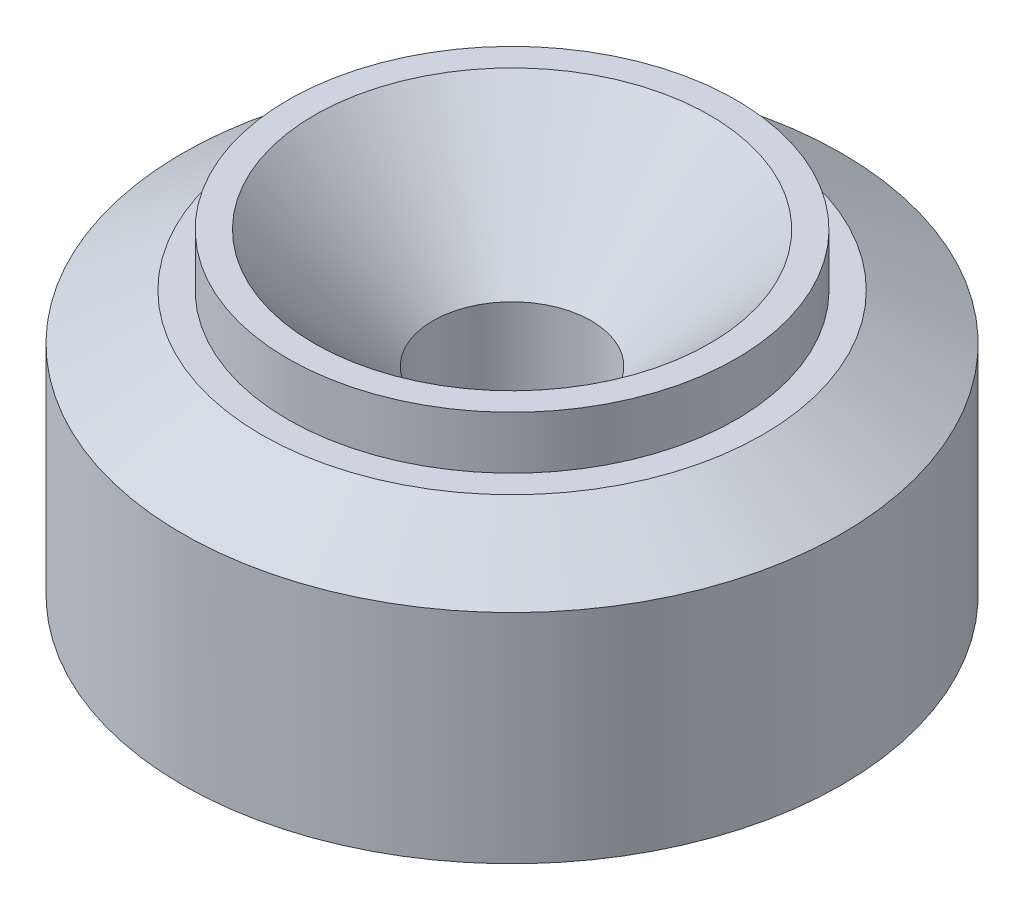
from build123d import *

# Parameters (mm, degrees)
SKICA1_R                 = 12.5
P_IDAT_VYSUNUT_M1_DEPTH  = 12
SKICA2_R                 = 7
ODEBRAT_VYSUNUT_M1_DEPTH = 2
SKICA3_R                 = 3
ODEBRAT_VYSUNUT_M2_DEPTH = 5.5
SKICA4_R                 = 7.5
ODEBRAT_VYSUNUT_M3_DEPTH = 4.5
ODEBRAT_VYSUNUT_M3_DRAFT = -45
SKICA5_OUTSIDE_W         = 34.468
SKICA5_OUTSIDE_H         = 34.468
SKICA5_OUTSIDE_R         = 8.5
ODEBRAT_VYSUNUT_M4_DEPTH = 2
ZKOSEN_1_SIZE            = 1.75
ZKOSEN_1_SIZE2           = 3


with BuildPart() as part:
    # Skica1 → P_idat vysunut_m1 (new body)
    with BuildSketch(Plane(origin=(0, 0, 0), x_dir=(1, 0, 0), z_dir=(0, 1, 0))):
        with Locations(Location((0, 0, 0), (0, 0, 270))):
            Circle(SKICA1_R)
    extrude(amount=P_IDAT_VYSUNUT_M1_DEPTH)

    # Skica2 → Odebrat vysunut_m1 (cut)
    with BuildSketch(Plane.XZ):
        with Locations(Location((0, 0, 0), (0, 0, 270))):
            Circle(SKICA2_R)
    extrude(amount=-ODEBRAT_VYSUNUT_M1_DEPTH, mode=Mode.SUBTRACT)

    # Skica3 → Odebrat vysunut_m2 (cut)
    with BuildSketch(Plane.XZ.offset(-2)):
        with Locations(Location((0, 0, 0), (0, 0, 270))):
            Circle(SKICA3_R)
    extrude(amount=-ODEBRAT_VYSUNUT_M2_DEPTH, mode=Mode.SUBTRACT)


with BuildPart() as odebrat_vysunut_m3_tool:
    # Skica4 → Odebrat vysunut_m3 (with draft: the straight prism first)
    with BuildSketch(Plane(origin=(0, 12, 0), x_dir=(-1, 0, 0), z_dir=(0, 1, 0))):
        Circle(SKICA4_R)
    extrude(amount=-ODEBRAT_VYSUNUT_M3_DEPTH)
    # Odebrat vysunut_m3: the draft: its side faces are tilted about the plane it starts from
    odebrat_vysunut_m3_sides = [odebrat_vysunut_m3_tool.faces().sort_by_distance(p)[0] for p in [
        (7.5, 9.75, 0),
    ]]
    draft(odebrat_vysunut_m3_sides, Plane(origin=(0, 12, 0), x_dir=(-1, 0, 0), z_dir=(0, 1, 0)), ODEBRAT_VYSUNUT_M3_DRAFT)


with BuildPart() as part_1:
    add(part.part)

    # Odebrat vysunut_m3: cut by odebrat_vysunut_m3_tool
    add(odebrat_vysunut_m3_tool.part, mode=Mode.SUBTRACT)

    # Skica5 outside → Odebrat vysunut_m4 (cut)
    with BuildSketch(Plane(origin=(0, 12, 0), x_dir=(-1, 0, 0), z_dir=(0, 1, 0))):
        Rectangle(SKICA5_OUTSIDE_W, SKICA5_OUTSIDE_H)
        with Locations(Location((0, 0, 0), (0, 0, 90))):
            Circle(SKICA5_OUTSIDE_R, mode=Mode.SUBTRACT)
    extrude(amount=-ODEBRAT_VYSUNUT_M4_DEPTH, mode=Mode.SUBTRACT)

    # Zkosen_1
    zkosen_1_edges = [part_1.edges().sort_by_distance(p)[0] for p in [
        (0, 10, -12.5),
    ]]
    zkosen_1_side = [part_1.faces().sort_by_distance(p)[0] for p in [
        (0, 5, -12.5),
    ]]
    chamfer(zkosen_1_edges, length=ZKOSEN_1_SIZE, length2=ZKOSEN_1_SIZE2, reference=zkosen_1_side[0])


solid = part_1.part
